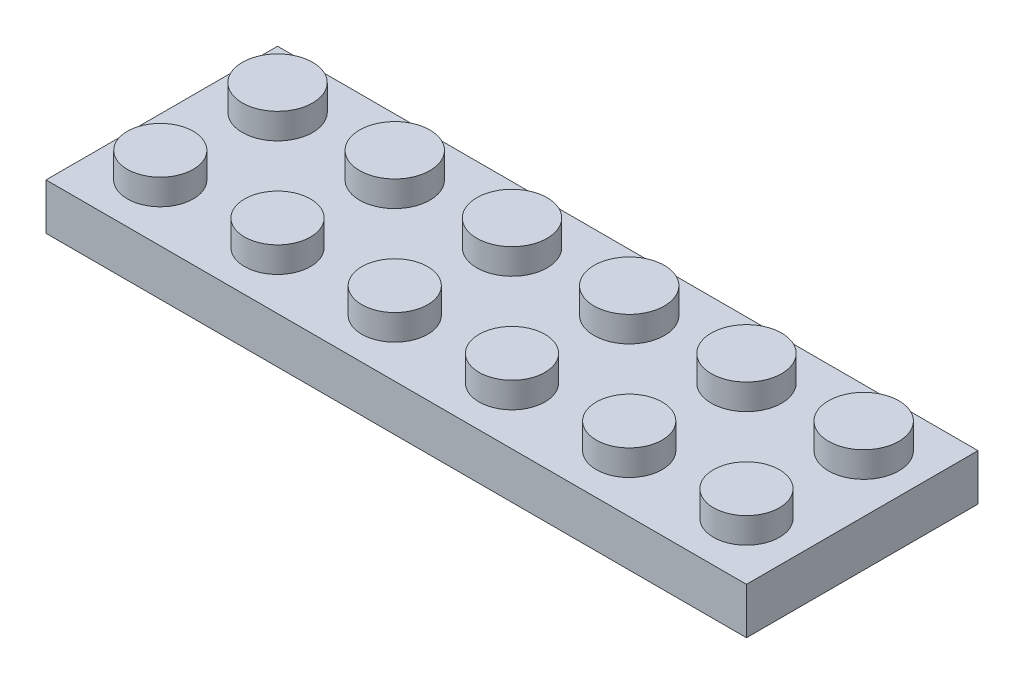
from build123d import *

# Parameters (mm, degrees)
SKETCH1_W       = 47.8
SKETCH1_H       = 15.8
EXTRUDE1_DEPTH  = 3.16
SKETCH2_R       = 2.400188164
SKETCH2_R_2     = 2.25
EXTRUDE2_DEPTH  = 1.75
SKETCH5_W       = 46.8
SKETCH5_H       = 14.8
EXTRUDE4_DEPTH  = 2.5
SKETCH6_R       = 3.4
EXTRUDE5_DEPTH  = 2.5
LPATTERN1_COUNT = 2
LPATTERN1_PITCH = 8
LPATTERN2_COUNT = 5
LPATTERN2_PITCH = 8
LPATTERN3_COUNT = 5
LPATTERN3_PITCH = 8


with BuildPart() as part:
    # Sketch1 → Extrude1 (new body)
    with BuildSketch(Plane(origin=(0, 0, 0), x_dir=(1, 0, 0), z_dir=(0, 1, 0))):
        Rectangle(SKETCH1_W, SKETCH1_H)
    extrude(amount=EXTRUDE1_DEPTH)

    # Sketch2 → Extrude2 (add)
    with BuildSketch(Plane(origin=(0, 3.16, 0), x_dir=(1, 0, 0), z_dir=(0, 1, 0))):
        with Locations(Location((12, 4, 0), (0, 0, 270))):
            Circle(SKETCH2_R)
        with Locations(Location((12, -4, 0), (0, 0, 270))):
            Circle(SKETCH2_R_2)
    extrude2 = extrude(amount=EXTRUDE2_DEPTH)

    # Sketch5 → Extrude4 (cut)
    with BuildSketch(Plane.XZ):
        Rectangle(SKETCH5_W, SKETCH5_H)
    extrude(amount=-EXTRUDE4_DEPTH, mode=Mode.SUBTRACT)

    # Sketch6 → Extrude5 (add)
    with BuildSketch(Plane.XZ.offset(-2.5)):
        with Locations(Location((15.9, 0, 0), (0, 0, 270))):
            Circle(SKETCH6_R)
    extrude5 = extrude(amount=EXTRUDE5_DEPTH)

    # LPattern1: Extrude2 ×2
    with Locations(*[(i * LPATTERN1_PITCH, 0, 0) for i in range(1, LPATTERN1_COUNT)]):
        add(extrude2)

    # LPattern2: Extrude2 ×5
    with Locations(*[(-i * LPATTERN2_PITCH, 0, 0) for i in range(1, LPATTERN2_COUNT)]):
        add(extrude2)

    # LPattern3: Extrude5 ×5
    with Locations(*[(-i * LPATTERN3_PITCH, 0, 0) for i in range(1, LPATTERN3_COUNT)]):
        add(extrude5)


solid = part.part
